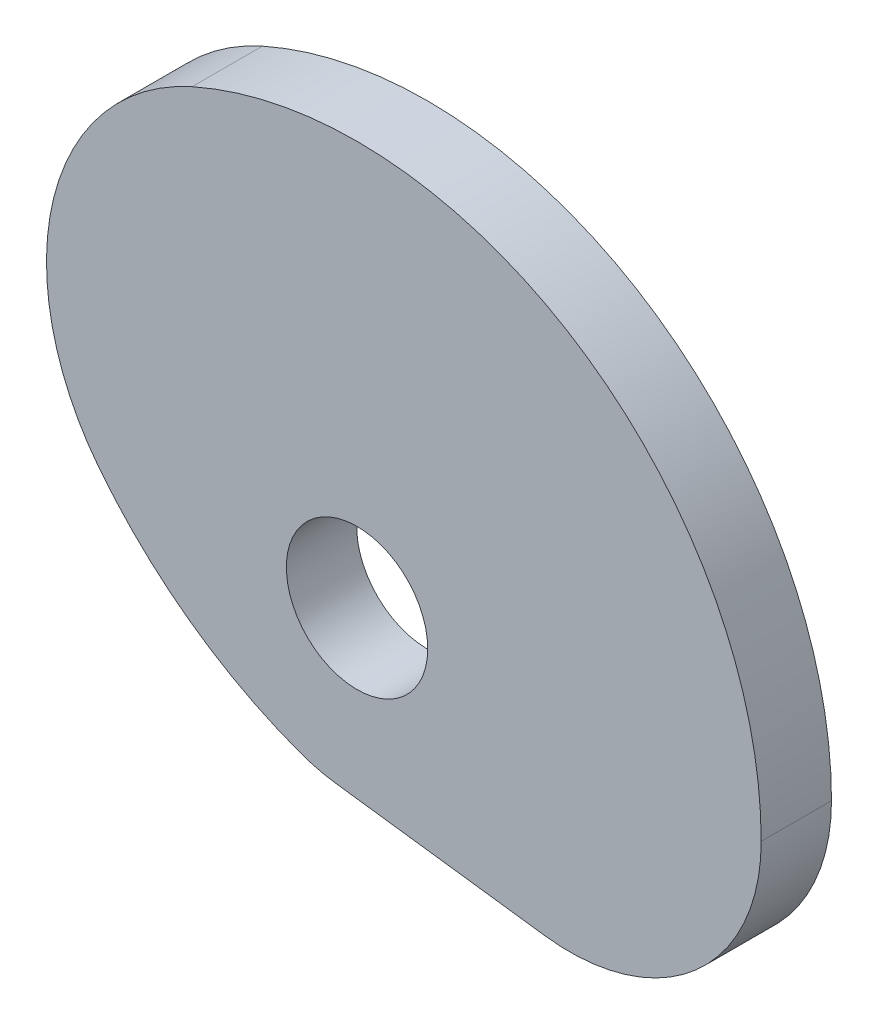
ISO-10303-21;
HEADER;
FILE_DESCRIPTION(('STEP AP214'),'2;1');
FILE_NAME('part.step','',(''),(''),'','','');
FILE_SCHEMA(('AUTOMOTIVE_DESIGN { 1 0 10303 214 1 1 1 1 }'));
ENDSEC;
DATA;
#1=APPLICATION_CONTEXT('core data for automotive mechanical design processes');
#2=APPLICATION_PROTOCOL_DEFINITION('international standard','automotive_design',2000,#1);
#3=PRODUCT_CONTEXT('',#1,'mechanical');
#4=PRODUCT('Part','Part','',(#3));
#5=PRODUCT_RELATED_PRODUCT_CATEGORY('part','',(#4));
#6=PRODUCT_DEFINITION_FORMATION('','',#4);
#7=PRODUCT_DEFINITION_CONTEXT('part definition',#1,'design');
#8=PRODUCT_DEFINITION('design','',#6,#7);
#9=PRODUCT_DEFINITION_SHAPE('','',#8);
#10=(LENGTH_UNIT() NAMED_UNIT(*) SI_UNIT(.MILLI.,.METRE.));
#11=(NAMED_UNIT(*) PLANE_ANGLE_UNIT() SI_UNIT($,.RADIAN.));
#12=(NAMED_UNIT(*) SI_UNIT($,.STERADIAN.) SOLID_ANGLE_UNIT());
#13=UNCERTAINTY_MEASURE_WITH_UNIT(LENGTH_MEASURE(1.E-05),#10,'distance_accuracy_value','');
#14=(GEOMETRIC_REPRESENTATION_CONTEXT(3) GLOBAL_UNCERTAINTY_ASSIGNED_CONTEXT((#13)) GLOBAL_UNIT_ASSIGNED_CONTEXT((#10,
#11,#12)) REPRESENTATION_CONTEXT('',''));
#15=CARTESIAN_POINT('',(0.,0.,0.));
#16=DIRECTION('',(0.,0.,1.));
#17=DIRECTION('',(1.,0.,0.));
#18=AXIS2_PLACEMENT_3D('',#15,#16,#17);
#19=CARTESIAN_POINT('',(60.5,0.,10.));
#20=DIRECTION('',(0.,0.,1.));
#21=DIRECTION('',(1.,0.,0.));
#22=AXIS2_PLACEMENT_3D('',#19,#20,#21);
#23=PLANE('',#22);
#24=CARTESIAN_POINT('',(60.5,0.,10.));
#25=DIRECTION('',(0.,0.,1.));
#26=DIRECTION('',(1.,0.,0.));
#27=AXIS2_PLACEMENT_3D('',#24,#25,#26);
#28=CIRCLE('',#27,54.4984637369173);
#29=CARTESIAN_POINT('',(53.4165842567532,-54.0361709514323,10.));
#30=VERTEX_POINT('',#29);
#31=CARTESIAN_POINT('',(114.998463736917,1.48262391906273E-08,10.));
#32=VERTEX_POINT('',#31);
#33=EDGE_CURVE('E434',#30,#32,#28,.T.);
#34=ORIENTED_EDGE('',*,*,#33,.T.);
#35=CARTESIAN_POINT('',(1.26653723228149E-07,-1.66122979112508E-08,10.));
#36=DIRECTION('',(0.,0.,1.));
#37=DIRECTION('',(1.,0.,0.));
#38=AXIS2_PLACEMENT_3D('',#35,#36,#37);
#39=CIRCLE('',#38,114.998463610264);
#40=CARTESIAN_POINT('',(-46.9446584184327,104.980215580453,10.));
#41=VERTEX_POINT('',#40);
#42=EDGE_CURVE('E415',#32,#41,#39,.T.);
#43=ORIENTED_EDGE('',*,*,#42,.T.);
#44=CARTESIAN_POINT('',(-18.37,41.08,10.));
#45=DIRECTION('',(0.,0.,1.));
#46=DIRECTION('',(1.,0.,0.));
#47=AXIS2_PLACEMENT_3D('',#44,#45,#46);
#48=CIRCLE('',#47,69.9982046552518);
#49=CARTESIAN_POINT('',(-73.3685437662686,-2.2202175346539,10.));
#50=VERTEX_POINT('',#49);
#51=EDGE_CURVE('E437',#41,#50,#48,.T.);
#52=ORIENTED_EDGE('',*,*,#51,.T.);
#53=CARTESIAN_POINT('',(28.55,78.02,10.));
#54=DIRECTION('',(0.,0.,1.));
#55=DIRECTION('',(1.,0.,0.));
#56=AXIS2_PLACEMENT_3D('',#53,#54,#55);
#57=CIRCLE('',#56,129.714617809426);
#58=CARTESIAN_POINT('',(-16.0259432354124,-43.7948897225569,10.));
#59=VERTEX_POINT('',#58);
#60=EDGE_CURVE('E439',#50,#59,#57,.T.);
#61=ORIENTED_EDGE('',*,*,#60,.T.);
#62=CARTESIAN_POINT('',(1.26653723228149E-07,-1.66122979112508E-08,10.));
#63=DIRECTION('',(0.,0.,1.));
#64=DIRECTION('',(1.,0.,0.));
#65=AXIS2_PLACEMENT_3D('',#62,#63,#64);
#66=CIRCLE('',#65,46.635);
#67=CARTESIAN_POINT('',(-6.06136510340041,-46.2394104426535,10.));
#68=VERTEX_POINT('',#67);
#69=EDGE_CURVE('E368',#59,#68,#66,.T.);
#70=ORIENTED_EDGE('',*,*,#69,.T.);
#71=DIRECTION('',(0.991517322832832,-0.129974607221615,0.));
#72=VECTOR('',#71,1.);
#73=CARTESIAN_POINT('',(-6.06136510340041,-46.2394104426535,10.));
#74=LINE('',#73,#72);
#75=EDGE_CURVE('E363',#68,#30,#74,.T.);
#76=ORIENTED_EDGE('',*,*,#75,.T.);
#77=EDGE_LOOP('',(#34,#43,#52,#61,#70,#76));
#78=FACE_BOUND('',#77,.T.);
#79=CARTESIAN_POINT('',(1.26653723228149E-07,-1.66122979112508E-08,10.));
#80=DIRECTION('',(0.,0.,1.));
#81=DIRECTION('',(1.,0.,0.));
#82=AXIS2_PLACEMENT_3D('',#79,#80,#81);
#83=CIRCLE('',#82,20.1104178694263);
#84=CARTESIAN_POINT('',(20.11041799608,-1.66122979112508E-08,10.));
#85=VERTEX_POINT('',#84);
#86=EDGE_CURVE('E420',#85,#85,#83,.T.);
#87=ORIENTED_EDGE('',*,*,#86,.F.);
#88=EDGE_LOOP('',(#87));
#89=FACE_BOUND('',#88,.T.);
#90=ADVANCED_FACE('F348',(#78,#89),#23,.T.);
#91=CARTESIAN_POINT('',(60.5,0.,-10.));
#92=DIRECTION('',(0.,0.,1.));
#93=DIRECTION('',(1.,0.,0.));
#94=AXIS2_PLACEMENT_3D('',#91,#92,#93);
#95=PLANE('',#94);
#96=CARTESIAN_POINT('',(60.5,0.,-10.));
#97=DIRECTION('',(0.,0.,1.));
#98=DIRECTION('',(1.,0.,0.));
#99=AXIS2_PLACEMENT_3D('',#96,#97,#98);
#100=CIRCLE('',#99,54.4984637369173);
#101=CARTESIAN_POINT('',(53.4165842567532,-54.0361709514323,-10.));
#102=VERTEX_POINT('',#101);
#103=CARTESIAN_POINT('',(114.998463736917,1.48262391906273E-08,-10.));
#104=VERTEX_POINT('',#103);
#105=EDGE_CURVE('E406',#102,#104,#100,.T.);
#106=ORIENTED_EDGE('',*,*,#105,.F.);
#107=DIRECTION('',(0.991517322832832,-0.129974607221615,0.));
#108=VECTOR('',#107,1.);
#109=CARTESIAN_POINT('',(-6.06136510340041,-46.2394104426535,-10.));
#110=LINE('',#109,#108);
#111=CARTESIAN_POINT('',(-6.06136510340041,-46.2394104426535,-10.));
#112=VERTEX_POINT('',#111);
#113=EDGE_CURVE('E432',#112,#102,#110,.T.);
#114=ORIENTED_EDGE('',*,*,#113,.F.);
#115=CARTESIAN_POINT('',(1.26653723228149E-07,-1.66122979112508E-08,-10.));
#116=DIRECTION('',(0.,0.,1.));
#117=DIRECTION('',(1.,0.,0.));
#118=AXIS2_PLACEMENT_3D('',#115,#116,#117);
#119=CIRCLE('',#118,46.635);
#120=CARTESIAN_POINT('',(-16.0259432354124,-43.7948897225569,-10.));
#121=VERTEX_POINT('',#120);
#122=EDGE_CURVE('E430',#121,#112,#119,.T.);
#123=ORIENTED_EDGE('',*,*,#122,.F.);
#124=CARTESIAN_POINT('',(28.55,78.02,-10.));
#125=DIRECTION('',(0.,0.,1.));
#126=DIRECTION('',(1.,0.,0.));
#127=AXIS2_PLACEMENT_3D('',#124,#125,#126);
#128=CIRCLE('',#127,129.714617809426);
#129=CARTESIAN_POINT('',(-73.3685437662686,-2.2202175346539,-10.));
#130=VERTEX_POINT('',#129);
#131=EDGE_CURVE('E428',#130,#121,#128,.T.);
#132=ORIENTED_EDGE('',*,*,#131,.F.);
#133=CARTESIAN_POINT('',(-18.37,41.08,-10.));
#134=DIRECTION('',(0.,0.,1.));
#135=DIRECTION('',(1.,0.,0.));
#136=AXIS2_PLACEMENT_3D('',#133,#134,#135);
#137=CIRCLE('',#136,69.9982046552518);
#138=CARTESIAN_POINT('',(-46.9446584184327,104.980215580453,-10.));
#139=VERTEX_POINT('',#138);
#140=EDGE_CURVE('E408',#139,#130,#137,.T.);
#141=ORIENTED_EDGE('',*,*,#140,.F.);
#142=CARTESIAN_POINT('',(1.26653723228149E-07,-1.66122979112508E-08,-10.));
#143=DIRECTION('',(0.,0.,1.));
#144=DIRECTION('',(1.,0.,0.));
#145=AXIS2_PLACEMENT_3D('',#142,#143,#144);
#146=CIRCLE('',#145,114.998463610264);
#147=EDGE_CURVE('E401',#104,#139,#146,.T.);
#148=ORIENTED_EDGE('',*,*,#147,.F.);
#149=EDGE_LOOP('',(#106,#114,#123,#132,#141,#148));
#150=FACE_BOUND('',#149,.T.);
#151=CARTESIAN_POINT('',(1.26653723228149E-07,-1.66122979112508E-08,-10.));
#152=DIRECTION('',(0.,0.,1.));
#153=DIRECTION('',(1.,0.,0.));
#154=AXIS2_PLACEMENT_3D('',#151,#152,#153);
#155=CIRCLE('',#154,20.1104178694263);
#156=CARTESIAN_POINT('',(20.11041799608,-1.66122979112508E-08,-10.));
#157=VERTEX_POINT('',#156);
#158=EDGE_CURVE('E423',#157,#157,#155,.T.);
#159=ORIENTED_EDGE('',*,*,#158,.T.);
#160=EDGE_LOOP('',(#159));
#161=FACE_BOUND('',#160,.T.);
#162=ADVANCED_FACE('F402',(#150,#161),#95,.F.);
#163=CARTESIAN_POINT('',(60.5,0.,10.));
#164=DIRECTION('',(0.,0.,-1.));
#165=DIRECTION('',(-1.,0.,0.));
#166=AXIS2_PLACEMENT_3D('',#163,#164,#165);
#167=CYLINDRICAL_SURFACE('',#166,54.4984637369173);
#168=ORIENTED_EDGE('',*,*,#105,.T.);
#169=DIRECTION('',(0.,0.,-1.));
#170=VECTOR('',#169,1.);
#171=CARTESIAN_POINT('',(114.998463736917,1.48262391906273E-08,10.));
#172=LINE('',#171,#170);
#173=EDGE_CURVE('E11',#32,#104,#172,.T.);
#174=ORIENTED_EDGE('',*,*,#173,.F.);
#175=ORIENTED_EDGE('',*,*,#33,.F.);
#176=DIRECTION('',(0.,0.,-1.));
#177=VECTOR('',#176,1.);
#178=CARTESIAN_POINT('',(53.4165842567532,-54.0361709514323,10.));
#179=LINE('',#178,#177);
#180=EDGE_CURVE('E419',#30,#102,#179,.T.);
#181=ORIENTED_EDGE('',*,*,#180,.T.);
#182=EDGE_LOOP('',(#168,#174,#175,#181));
#183=FACE_BOUND('',#182,.T.);
#184=ADVANCED_FACE('F350',(#183),#167,.T.);
#185=CARTESIAN_POINT('',(1.26653723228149E-07,-1.66122979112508E-08,10.));
#186=DIRECTION('',(0.,0.,-1.));
#187=DIRECTION('',(-1.,0.,0.));
#188=AXIS2_PLACEMENT_3D('',#185,#186,#187);
#189=CYLINDRICAL_SURFACE('',#188,114.998463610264);
#190=ORIENTED_EDGE('',*,*,#147,.T.);
#191=DIRECTION('',(0.,0.,-1.));
#192=VECTOR('',#191,1.);
#193=CARTESIAN_POINT('',(-46.9446584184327,104.980215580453,10.));
#194=LINE('',#193,#192);
#195=EDGE_CURVE('E356',#41,#139,#194,.T.);
#196=ORIENTED_EDGE('',*,*,#195,.F.);
#197=ORIENTED_EDGE('',*,*,#42,.F.);
#198=ORIENTED_EDGE('',*,*,#173,.T.);
#199=EDGE_LOOP('',(#190,#196,#197,#198));
#200=FACE_BOUND('',#199,.T.);
#201=ADVANCED_FACE('F414',(#200),#189,.T.);
#202=CARTESIAN_POINT('',(-18.37,41.08,10.));
#203=DIRECTION('',(0.,0.,-1.));
#204=DIRECTION('',(-1.,0.,0.));
#205=AXIS2_PLACEMENT_3D('',#202,#203,#204);
#206=CYLINDRICAL_SURFACE('',#205,69.9982046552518);
#207=ORIENTED_EDGE('',*,*,#140,.T.);
#208=DIRECTION('',(0.,0.,-1.));
#209=VECTOR('',#208,1.);
#210=CARTESIAN_POINT('',(-73.3685437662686,-2.2202175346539,10.));
#211=LINE('',#210,#209);
#212=EDGE_CURVE('E450',#50,#130,#211,.T.);
#213=ORIENTED_EDGE('',*,*,#212,.F.);
#214=ORIENTED_EDGE('',*,*,#51,.F.);
#215=ORIENTED_EDGE('',*,*,#195,.T.);
#216=EDGE_LOOP('',(#207,#213,#214,#215));
#217=FACE_BOUND('',#216,.T.);
#218=ADVANCED_FACE('F454',(#217),#206,.T.);
#219=CARTESIAN_POINT('',(28.55,78.02,10.));
#220=DIRECTION('',(0.,0.,-1.));
#221=DIRECTION('',(-1.,0.,0.));
#222=AXIS2_PLACEMENT_3D('',#219,#220,#221);
#223=CYLINDRICAL_SURFACE('',#222,129.714617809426);
#224=ORIENTED_EDGE('',*,*,#131,.T.);
#225=DIRECTION('',(0.,0.,-1.));
#226=VECTOR('',#225,1.);
#227=CARTESIAN_POINT('',(-16.0259432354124,-43.7948897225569,10.));
#228=LINE('',#227,#226);
#229=EDGE_CURVE('E447',#59,#121,#228,.T.);
#230=ORIENTED_EDGE('',*,*,#229,.F.);
#231=ORIENTED_EDGE('',*,*,#60,.F.);
#232=ORIENTED_EDGE('',*,*,#212,.T.);
#233=EDGE_LOOP('',(#224,#230,#231,#232));
#234=FACE_BOUND('',#233,.T.);
#235=ADVANCED_FACE('F460',(#234),#223,.T.);
#236=CARTESIAN_POINT('',(1.26653723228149E-07,-1.66122979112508E-08,10.));
#237=DIRECTION('',(0.,0.,-1.));
#238=DIRECTION('',(-1.,0.,0.));
#239=AXIS2_PLACEMENT_3D('',#236,#237,#238);
#240=CYLINDRICAL_SURFACE('',#239,46.635);
#241=ORIENTED_EDGE('',*,*,#122,.T.);
#242=DIRECTION('',(0.,0.,-1.));
#243=VECTOR('',#242,1.);
#244=CARTESIAN_POINT('',(-6.06136510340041,-46.2394104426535,10.));
#245=LINE('',#244,#243);
#246=EDGE_CURVE('E444',#68,#112,#245,.T.);
#247=ORIENTED_EDGE('',*,*,#246,.F.);
#248=ORIENTED_EDGE('',*,*,#69,.F.);
#249=ORIENTED_EDGE('',*,*,#229,.T.);
#250=EDGE_LOOP('',(#241,#247,#248,#249));
#251=FACE_BOUND('',#250,.T.);
#252=ADVANCED_FACE('F463',(#251),#240,.T.);
#253=CARTESIAN_POINT('',(-6.06136510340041,-46.2394104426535,10.));
#254=DIRECTION('',(0.129974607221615,0.991517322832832,0.));
#255=DIRECTION('',(-0.991517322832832,0.129974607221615,0.));
#256=AXIS2_PLACEMENT_3D('',#253,#254,#255);
#257=PLANE('',#256);
#258=ORIENTED_EDGE('',*,*,#113,.T.);
#259=ORIENTED_EDGE('',*,*,#180,.F.);
#260=ORIENTED_EDGE('',*,*,#75,.F.);
#261=ORIENTED_EDGE('',*,*,#246,.T.);
#262=EDGE_LOOP('',(#258,#259,#260,#261));
#263=FACE_BOUND('',#262,.T.);
#264=ADVANCED_FACE('F465',(#263),#257,.F.);
#265=CARTESIAN_POINT('',(1.26653723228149E-07,-1.66122979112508E-08,10.));
#266=DIRECTION('',(0.,0.,-1.));
#267=DIRECTION('',(-1.,0.,0.));
#268=AXIS2_PLACEMENT_3D('',#265,#266,#267);
#269=CYLINDRICAL_SURFACE('',#268,20.1104178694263);
#270=ORIENTED_EDGE('',*,*,#86,.T.);
#271=EDGE_LOOP('',(#270));
#272=FACE_BOUND('',#271,.T.);
#273=ORIENTED_EDGE('',*,*,#158,.F.);
#274=EDGE_LOOP('',(#273));
#275=FACE_BOUND('',#274,.T.);
#276=ADVANCED_FACE('F467',(#272,#275),#269,.F.);
#277=CLOSED_SHELL('',(#90,#162,#184,#201,#218,#235,#252,#264,#276));
#278=MANIFOLD_SOLID_BREP('B2',#277);
#279=ADVANCED_BREP_SHAPE_REPRESENTATION('',(#18,#278),#14);
#280=SHAPE_DEFINITION_REPRESENTATION(#9,#279);
ENDSEC;
END-ISO-10303-21;
